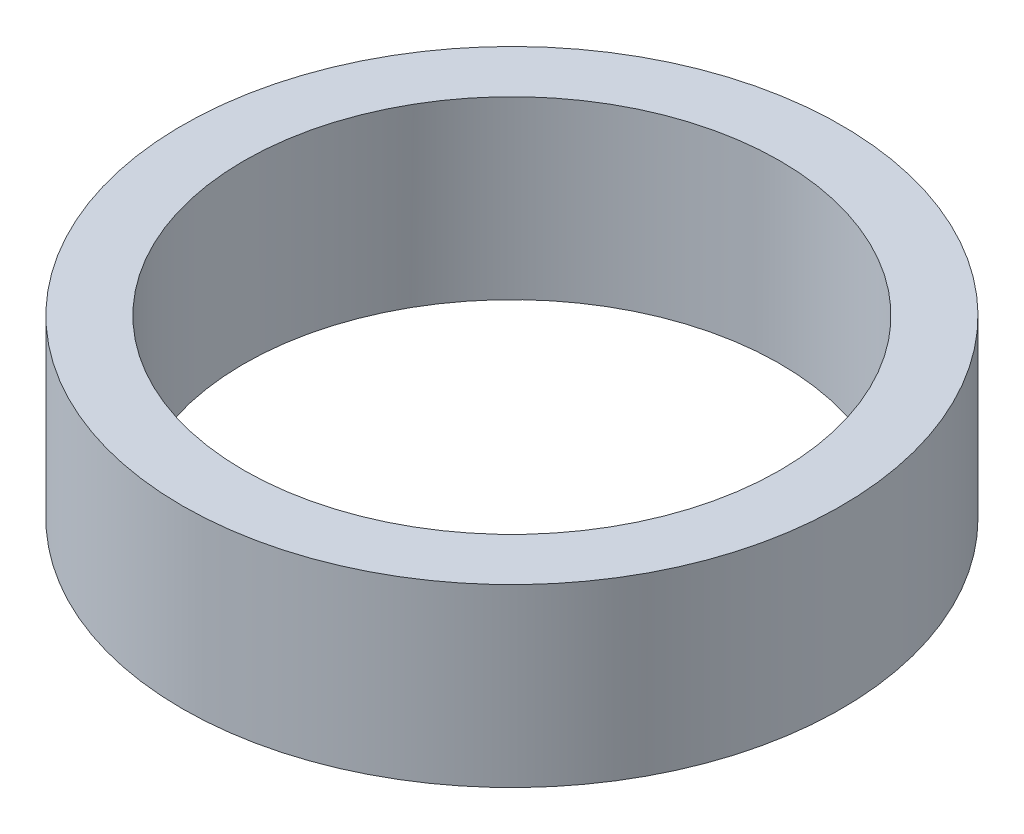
from build123d import *

# Parameters (mm, degrees)
SKETCH1_R           = 4.7625
SKETCH1_R_2         = 3.8735
BOSS_EXTRUDE1_DEPTH = 2.54


with BuildPart() as part:
    # Sketch1 → Boss-Extrude1 (new body)
    with BuildSketch(Plane(origin=(0, 0, 0), x_dir=(1, 0, 0), z_dir=(0, 1, 0))):
        with Locations(Location((0, 0, 0), (0, 0, 270))):
            Circle(SKETCH1_R)
        with Locations(Location((0, 0, 0), (0, 0, 270))):
            Circle(SKETCH1_R_2, mode=Mode.SUBTRACT)
    extrude(amount=-BOSS_EXTRUDE1_DEPTH)


solid = part.part
